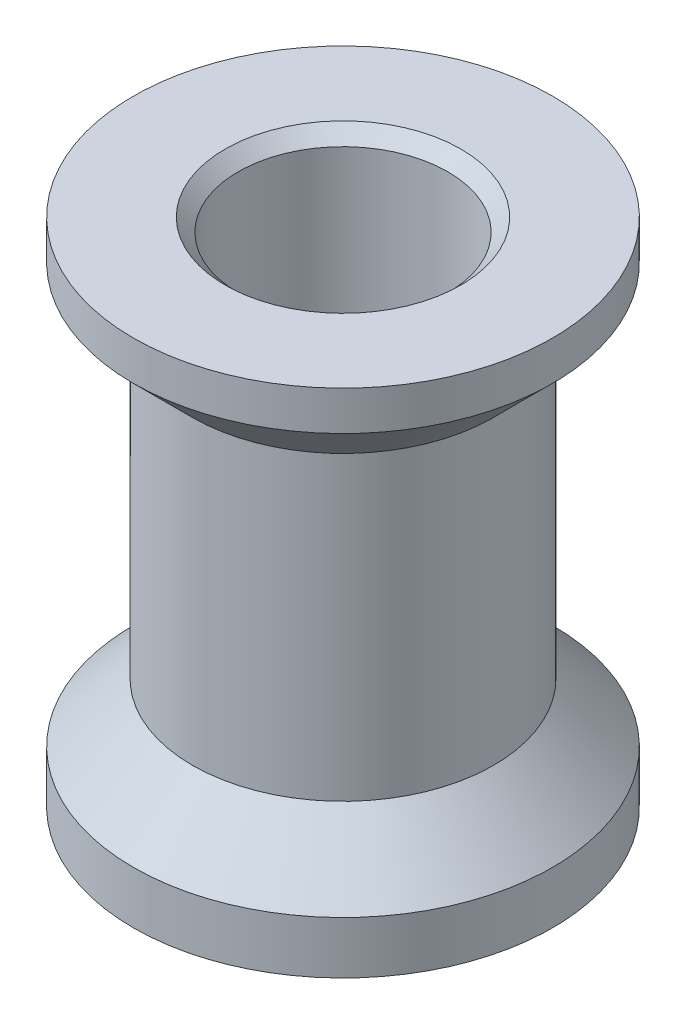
ISO-10303-21;
HEADER;
FILE_DESCRIPTION(('STEP AP214'),'2;1');
FILE_NAME('part.step','',(''),(''),'','','');
FILE_SCHEMA(('AUTOMOTIVE_DESIGN { 1 0 10303 214 1 1 1 1 }'));
ENDSEC;
DATA;
#1=APPLICATION_CONTEXT('core data for automotive mechanical design processes');
#2=APPLICATION_PROTOCOL_DEFINITION('international standard','automotive_design',2000,#1);
#3=PRODUCT_CONTEXT('',#1,'mechanical');
#4=PRODUCT('Part','Part','',(#3));
#5=PRODUCT_RELATED_PRODUCT_CATEGORY('part','',(#4));
#6=PRODUCT_DEFINITION_FORMATION('','',#4);
#7=PRODUCT_DEFINITION_CONTEXT('part definition',#1,'design');
#8=PRODUCT_DEFINITION('design','',#6,#7);
#9=PRODUCT_DEFINITION_SHAPE('','',#8);
#10=(LENGTH_UNIT() NAMED_UNIT(*) SI_UNIT(.MILLI.,.METRE.));
#11=(NAMED_UNIT(*) PLANE_ANGLE_UNIT() SI_UNIT($,.RADIAN.));
#12=(NAMED_UNIT(*) SI_UNIT($,.STERADIAN.) SOLID_ANGLE_UNIT());
#13=UNCERTAINTY_MEASURE_WITH_UNIT(LENGTH_MEASURE(1.E-05),#10,'distance_accuracy_value','');
#14=(GEOMETRIC_REPRESENTATION_CONTEXT(3) GLOBAL_UNCERTAINTY_ASSIGNED_CONTEXT((#13)) GLOBAL_UNIT_ASSIGNED_CONTEXT((#10,
#11,#12)) REPRESENTATION_CONTEXT('',''));
#15=CARTESIAN_POINT('',(0.,0.,0.));
#16=DIRECTION('',(0.,0.,1.));
#17=DIRECTION('',(1.,0.,0.));
#18=AXIS2_PLACEMENT_3D('',#15,#16,#17);
#19=CARTESIAN_POINT('',(0.,9.75,0.));
#20=DIRECTION('',(0.,1.,0.));
#21=DIRECTION('',(0.,0.,1.));
#22=AXIS2_PLACEMENT_3D('',#19,#20,#21);
#23=CYLINDRICAL_SURFACE('',#22,8.);
#24=CARTESIAN_POINT('',(0.,9.75,0.));
#25=DIRECTION('',(0.,1.,0.));
#26=DIRECTION('',(0.,0.,1.));
#27=AXIS2_PLACEMENT_3D('',#24,#25,#26);
#28=CIRCLE('',#27,8.);
#29=CARTESIAN_POINT('',(0.,9.75,8.));
#30=VERTEX_POINT('',#29);
#31=EDGE_CURVE('E77',#30,#30,#28,.T.);
#32=ORIENTED_EDGE('',*,*,#31,.F.);
#33=EDGE_LOOP('',(#32));
#34=FACE_BOUND('',#33,.T.);
#35=CARTESIAN_POINT('',(0.,8.25,0.));
#36=DIRECTION('',(0.,1.,0.));
#37=DIRECTION('',(0.,0.,1.));
#38=AXIS2_PLACEMENT_3D('',#35,#36,#37);
#39=CIRCLE('',#38,8.);
#40=CARTESIAN_POINT('',(0.,8.25,8.));
#41=VERTEX_POINT('',#40);
#42=EDGE_CURVE('E50',#41,#41,#39,.T.);
#43=ORIENTED_EDGE('',*,*,#42,.T.);
#44=EDGE_LOOP('',(#43));
#45=FACE_BOUND('',#44,.T.);
#46=ADVANCED_FACE('F37',(#34,#45),#23,.T.);
#47=CARTESIAN_POINT('',(0.,6.00000000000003,0.));
#48=DIRECTION('',(0.,1.,0.));
#49=DIRECTION('',(0.,0.,1.));
#50=AXIS2_PLACEMENT_3D('',#47,#48,#49);
#51=CONICAL_SURFACE('',#50,5.75,0.785398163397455);
#52=ORIENTED_EDGE('',*,*,#42,.F.);
#53=EDGE_LOOP('',(#52));
#54=FACE_BOUND('',#53,.T.);
#55=CARTESIAN_POINT('',(0.,6.00000000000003,0.));
#56=DIRECTION('',(0.,1.,0.));
#57=DIRECTION('',(0.,0.,1.));
#58=AXIS2_PLACEMENT_3D('',#55,#56,#57);
#59=CIRCLE('',#58,5.75);
#60=CARTESIAN_POINT('',(0.,6.00000000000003,5.74999999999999));
#61=VERTEX_POINT('',#60);
#62=EDGE_CURVE('E55',#61,#61,#59,.T.);
#63=ORIENTED_EDGE('',*,*,#62,.T.);
#64=EDGE_LOOP('',(#63));
#65=FACE_BOUND('',#64,.T.);
#66=ADVANCED_FACE('F86',(#54,#65),#51,.T.);
#67=CARTESIAN_POINT('',(0.,9.75,0.));
#68=DIRECTION('',(0.,1.,0.));
#69=DIRECTION('',(0.,0.,1.));
#70=AXIS2_PLACEMENT_3D('',#67,#68,#69);
#71=CYLINDRICAL_SURFACE('',#70,5.75);
#72=ORIENTED_EDGE('',*,*,#62,.F.);
#73=EDGE_LOOP('',(#72));
#74=FACE_BOUND('',#73,.T.);
#75=CARTESIAN_POINT('',(0.,-5.50000000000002,0.));
#76=DIRECTION('',(0.,1.,0.));
#77=DIRECTION('',(0.,0.,1.));
#78=AXIS2_PLACEMENT_3D('',#75,#76,#77);
#79=CIRCLE('',#78,5.75);
#80=CARTESIAN_POINT('',(0.,-5.50000000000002,5.75));
#81=VERTEX_POINT('',#80);
#82=EDGE_CURVE('E61',#81,#81,#79,.T.);
#83=ORIENTED_EDGE('',*,*,#82,.T.);
#84=EDGE_LOOP('',(#83));
#85=FACE_BOUND('',#84,.T.);
#86=ADVANCED_FACE('F91',(#74,#85),#71,.T.);
#87=CARTESIAN_POINT('',(0.,-7.75,0.));
#88=DIRECTION('',(0.,-1.,0.));
#89=DIRECTION('',(0.,0.,-1.));
#90=AXIS2_PLACEMENT_3D('',#87,#88,#89);
#91=CONICAL_SURFACE('',#90,8.,0.785398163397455);
#92=ORIENTED_EDGE('',*,*,#82,.F.);
#93=EDGE_LOOP('',(#92));
#94=FACE_BOUND('',#93,.T.);
#95=CARTESIAN_POINT('',(0.,-7.75,0.));
#96=DIRECTION('',(0.,1.,0.));
#97=DIRECTION('',(0.,0.,1.));
#98=AXIS2_PLACEMENT_3D('',#95,#96,#97);
#99=CIRCLE('',#98,8.);
#100=CARTESIAN_POINT('',(0.,-7.75,8.));
#101=VERTEX_POINT('',#100);
#102=EDGE_CURVE('E65',#101,#101,#99,.T.);
#103=ORIENTED_EDGE('',*,*,#102,.T.);
#104=EDGE_LOOP('',(#103));
#105=FACE_BOUND('',#104,.T.);
#106=ADVANCED_FACE('F97',(#94,#105),#91,.T.);
#107=CARTESIAN_POINT('',(0.,9.75,0.));
#108=DIRECTION('',(0.,1.,0.));
#109=DIRECTION('',(0.,0.,1.));
#110=AXIS2_PLACEMENT_3D('',#107,#108,#109);
#111=CYLINDRICAL_SURFACE('',#110,8.);
#112=ORIENTED_EDGE('',*,*,#102,.F.);
#113=EDGE_LOOP('',(#112));
#114=FACE_BOUND('',#113,.T.);
#115=CARTESIAN_POINT('',(0.,-9.75,0.));
#116=DIRECTION('',(0.,1.,0.));
#117=DIRECTION('',(0.,0.,1.));
#118=AXIS2_PLACEMENT_3D('',#115,#116,#117);
#119=CIRCLE('',#118,8.);
#120=CARTESIAN_POINT('',(0.,-9.75,8.));
#121=VERTEX_POINT('',#120);
#122=EDGE_CURVE('E69',#121,#121,#119,.T.);
#123=ORIENTED_EDGE('',*,*,#122,.T.);
#124=EDGE_LOOP('',(#123));
#125=FACE_BOUND('',#124,.T.);
#126=ADVANCED_FACE('F103',(#114,#125),#111,.T.);
#127=CARTESIAN_POINT('',(0.,-9.75,-8.));
#128=DIRECTION('',(0.,1.,0.));
#129=DIRECTION('',(0.,0.,1.));
#130=AXIS2_PLACEMENT_3D('',#127,#128,#129);
#131=PLANE('',#130);
#132=ORIENTED_EDGE('',*,*,#122,.F.);
#133=EDGE_LOOP('',(#132));
#134=FACE_BOUND('',#133,.T.);
#135=CARTESIAN_POINT('',(0.,-9.75,0.));
#136=DIRECTION('',(0.,1.,0.));
#137=DIRECTION('',(0.,0.,1.));
#138=AXIS2_PLACEMENT_3D('',#135,#136,#137);
#139=CIRCLE('',#138,4.);
#140=CARTESIAN_POINT('',(0.,-9.75,3.99999999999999));
#141=VERTEX_POINT('',#140);
#142=EDGE_CURVE('E73',#141,#141,#139,.T.);
#143=ORIENTED_EDGE('',*,*,#142,.T.);
#144=EDGE_LOOP('',(#143));
#145=FACE_BOUND('',#144,.T.);
#146=ADVANCED_FACE('F109',(#134,#145),#131,.F.);
#147=CARTESIAN_POINT('',(0.,9.75,0.));
#148=DIRECTION('',(0.,1.,0.));
#149=DIRECTION('',(0.,0.,1.));
#150=AXIS2_PLACEMENT_3D('',#147,#148,#149);
#151=CYLINDRICAL_SURFACE('',#150,4.);
#152=CARTESIAN_POINT('',(0.,9.24999999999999,0.));
#153=DIRECTION('',(0.,-1.,0.));
#154=DIRECTION('',(0.,0.,-1.));
#155=AXIS2_PLACEMENT_3D('',#152,#153,#154);
#156=CIRCLE('',#155,4.);
#157=CARTESIAN_POINT('',(0.,9.24999999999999,-4.));
#158=VERTEX_POINT('',#157);
#159=EDGE_CURVE('E45',#158,#158,#156,.F.);
#160=ORIENTED_EDGE('',*,*,#159,.T.);
#161=EDGE_LOOP('',(#160));
#162=FACE_BOUND('',#161,.T.);
#163=ORIENTED_EDGE('',*,*,#142,.F.);
#164=EDGE_LOOP('',(#163));
#165=FACE_BOUND('',#164,.T.);
#166=ADVANCED_FACE('F115',(#162,#165),#151,.F.);
#167=CARTESIAN_POINT('',(0.,9.75,-4.));
#168=DIRECTION('',(0.,-1.,0.));
#169=DIRECTION('',(0.,0.,-1.));
#170=AXIS2_PLACEMENT_3D('',#167,#168,#169);
#171=PLANE('',#170);
#172=CARTESIAN_POINT('',(0.,9.75,0.));
#173=DIRECTION('',(0.,-1.,0.));
#174=DIRECTION('',(0.,0.,-1.));
#175=AXIS2_PLACEMENT_3D('',#172,#173,#174);
#176=CIRCLE('',#175,4.5);
#177=CARTESIAN_POINT('',(0.,9.75,-4.50000000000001));
#178=VERTEX_POINT('',#177);
#179=EDGE_CURVE('E10',#178,#178,#176,.T.);
#180=ORIENTED_EDGE('',*,*,#179,.T.);
#181=EDGE_LOOP('',(#180));
#182=FACE_BOUND('',#181,.T.);
#183=ORIENTED_EDGE('',*,*,#31,.T.);
#184=EDGE_LOOP('',(#183));
#185=FACE_BOUND('',#184,.T.);
#186=ADVANCED_FACE('F82',(#182,#185),#171,.F.);
#187=CARTESIAN_POINT('',(0.,9.24999999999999,0.));
#188=DIRECTION('',(0.,1.,0.));
#189=DIRECTION('',(0.,0.,1.));
#190=AXIS2_PLACEMENT_3D('',#187,#188,#189);
#191=CONICAL_SURFACE('',#190,4.,0.785398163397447);
#192=ORIENTED_EDGE('',*,*,#179,.F.);
#193=EDGE_LOOP('',(#192));
#194=FACE_BOUND('',#193,.T.);
#195=ORIENTED_EDGE('',*,*,#159,.F.);
#196=EDGE_LOOP('',(#195));
#197=FACE_BOUND('',#196,.T.);
#198=ADVANCED_FACE('F39',(#194,#197),#191,.F.);
#199=CLOSED_SHELL('',(#46,#66,#86,#106,#126,#146,#166,#186,#198));
#200=MANIFOLD_SOLID_BREP('B2',#199);
#201=ADVANCED_BREP_SHAPE_REPRESENTATION('',(#18,#200),#14);
#202=SHAPE_DEFINITION_REPRESENTATION(#9,#201);
ENDSEC;
END-ISO-10303-21;
